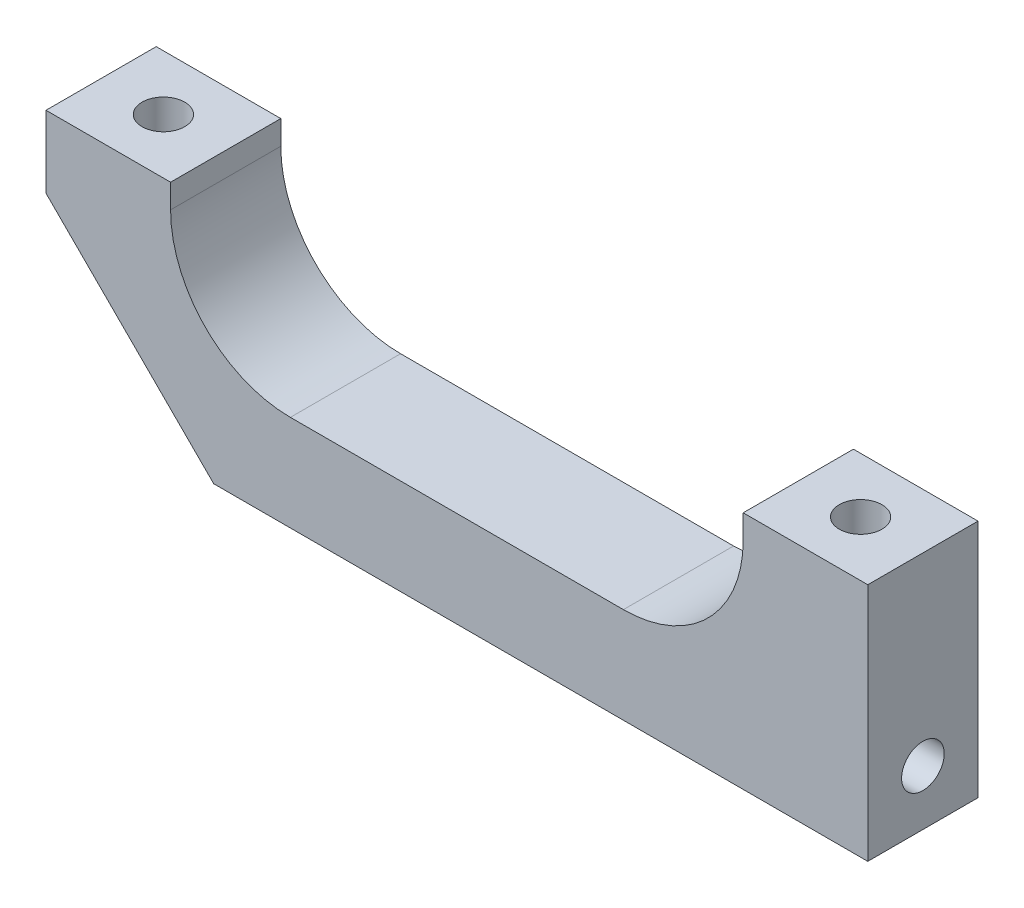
from build123d import *

# Parameters (mm, degrees)
SKETCH1_W                 = 43.561
SKETCH1_H                 = 12.7
EXTRUDE1_DEPTH            = 5.842
SKETCH2_W                 = 30.353
SKETCH2_H                 = 7.62
CUT_EXTRUDE1_DEPTH        = 46.749094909
CHAMFER1_SIZE             = 8.89
FILLET1_R                 = 6.35
F_4_40_TAPPED_HOLE2_D     = 2.2606
F_4_40_TAPPED_HOLE2_DEPTH = 8.509
F_4_40_TAPPED_HOLE2_TIP   = 0.679152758
F_4_40_TAPPED_HOLE3_D     = 2.2606
F_4_40_TAPPED_HOLE3_DEPTH = 7.5946
F_4_40_TAPPED_HOLE3_TIP   = 0.679152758


with BuildPart() as part:
    # Sketch1 → Extrude1 (new body)
    with BuildSketch(Plane.XY):
        with Locations((21.7805, -6.35)):
            Rectangle(SKETCH1_W, SKETCH1_H)
    extrude(amount=EXTRUDE1_DEPTH)

    # Sketch2 → Cut-Extrude1 (cut, through all)
    with BuildSketch(Plane.XY.offset(5.842)):
        with Locations((21.7805, -3.81)):
            Rectangle(SKETCH2_W, SKETCH2_H)
    extrude(amount=-CUT_EXTRUDE1_DEPTH, mode=Mode.SUBTRACT)

    # Chamfer1
    chamfer1_edges = [part.edges().sort_by_distance(p)[0] for p in [
        (0, -12.7, 2.921),
    ]]
    chamfer(chamfer1_edges, length=CHAMFER1_SIZE)

    # Fillet1
    fillet1_edges = [part.edges().sort_by_distance(p)[0] for p in [
        (6.604, -7.62, 2.921),
        (36.957, -7.62, 2.921),
    ]]
    fillet(fillet1_edges, radius=FILLET1_R)

    # 4-40 Tapped Hole2
    with Locations(Plane(origin=(43.561, 0, 0), x_dir=(0, 0, -1), z_dir=(1, 0, 0))):
        with Locations((-2.921, -9.779)):
            Hole(F_4_40_TAPPED_HOLE2_D / 2, depth=F_4_40_TAPPED_HOLE2_DEPTH)
            with Locations((0, 0, -(F_4_40_TAPPED_HOLE2_DEPTH + F_4_40_TAPPED_HOLE2_TIP / 2))):  # 118° drill point
                Cone(0, F_4_40_TAPPED_HOLE2_D / 2, F_4_40_TAPPED_HOLE2_TIP, mode=Mode.SUBTRACT)

    # 4-40 Tapped Hole3
    with Locations(Plane(origin=(0, 0, 0), x_dir=(-1, 0, 0), z_dir=(0, 1, 0))):
        with Locations((-3.302, 2.921), (-40.259, 2.921)):
            Hole(F_4_40_TAPPED_HOLE3_D / 2, depth=F_4_40_TAPPED_HOLE3_DEPTH)
            with Locations((0, 0, -(F_4_40_TAPPED_HOLE3_DEPTH + F_4_40_TAPPED_HOLE3_TIP / 2))):  # 118° drill point
                Cone(0, F_4_40_TAPPED_HOLE3_D / 2, F_4_40_TAPPED_HOLE3_TIP, mode=Mode.SUBTRACT)


solid = part.part
